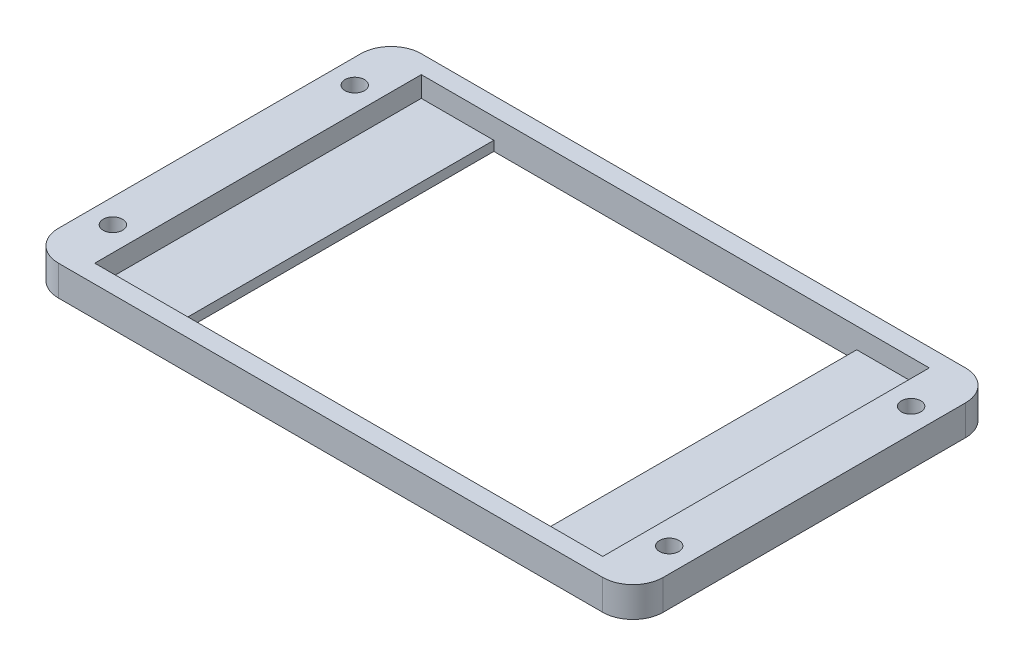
ISO-10303-21;
HEADER;
FILE_DESCRIPTION(('STEP AP214'),'2;1');
FILE_NAME('part.step','',(''),(''),'','','');
FILE_SCHEMA(('AUTOMOTIVE_DESIGN { 1 0 10303 214 1 1 1 1 }'));
ENDSEC;
DATA;
#1=APPLICATION_CONTEXT('core data for automotive mechanical design processes');
#2=APPLICATION_PROTOCOL_DEFINITION('international standard','automotive_design',2000,#1);
#3=PRODUCT_CONTEXT('',#1,'mechanical');
#4=PRODUCT('Part','Part','',(#3));
#5=PRODUCT_RELATED_PRODUCT_CATEGORY('part','',(#4));
#6=PRODUCT_DEFINITION_FORMATION('','',#4);
#7=PRODUCT_DEFINITION_CONTEXT('part definition',#1,'design');
#8=PRODUCT_DEFINITION('design','',#6,#7);
#9=PRODUCT_DEFINITION_SHAPE('','',#8);
#10=(LENGTH_UNIT() NAMED_UNIT(*) SI_UNIT(.MILLI.,.METRE.));
#11=(NAMED_UNIT(*) PLANE_ANGLE_UNIT() SI_UNIT($,.RADIAN.));
#12=(NAMED_UNIT(*) SI_UNIT($,.STERADIAN.) SOLID_ANGLE_UNIT());
#13=UNCERTAINTY_MEASURE_WITH_UNIT(LENGTH_MEASURE(1.E-05),#10,'distance_accuracy_value','');
#14=(GEOMETRIC_REPRESENTATION_CONTEXT(3) GLOBAL_UNCERTAINTY_ASSIGNED_CONTEXT((#13)) GLOBAL_UNIT_ASSIGNED_CONTEXT((#10,
#11,#12)) REPRESENTATION_CONTEXT('',''));
#15=CARTESIAN_POINT('',(0.,0.,0.));
#16=DIRECTION('',(0.,0.,1.));
#17=DIRECTION('',(1.,0.,0.));
#18=AXIS2_PLACEMENT_3D('',#15,#16,#17);
#19=CARTESIAN_POINT('',(0.,2.032,0.));
#20=DIRECTION('',(0.,-1.,0.));
#21=DIRECTION('',(0.,0.,-1.));
#22=AXIS2_PLACEMENT_3D('',#19,#20,#21);
#23=PLANE('',#22);
#24=DIRECTION('',(0.,0.,1.));
#25=VECTOR('',#24,1.);
#26=CARTESIAN_POINT('',(25.4,2.032,-72.39));
#27=LINE('',#26,#25);
#28=CARTESIAN_POINT('',(25.4,2.032,-72.39));
#29=VERTEX_POINT('',#28);
#30=CARTESIAN_POINT('',(25.4,2.032,-3.81000000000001));
#31=VERTEX_POINT('',#30);
#32=EDGE_CURVE('E154',#29,#31,#27,.T.);
#33=ORIENTED_EDGE('',*,*,#32,.F.);
#34=DIRECTION('',(-1.,0.,0.));
#35=VECTOR('',#34,1.);
#36=CARTESIAN_POINT('',(10.16,2.032,-72.39));
#37=LINE('',#36,#35);
#38=CARTESIAN_POINT('',(10.16,2.032,-72.39));
#39=VERTEX_POINT('',#38);
#40=EDGE_CURVE('E289',#29,#39,#37,.T.);
#41=ORIENTED_EDGE('',*,*,#40,.T.);
#42=DIRECTION('',(0.,0.,1.));
#43=VECTOR('',#42,1.);
#44=CARTESIAN_POINT('',(10.16,2.032,-3.81000000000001));
#45=LINE('',#44,#43);
#46=CARTESIAN_POINT('',(10.16,2.032,-3.81000000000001));
#47=VERTEX_POINT('',#46);
#48=EDGE_CURVE('E285',#39,#47,#45,.T.);
#49=ORIENTED_EDGE('',*,*,#48,.T.);
#50=DIRECTION('',(1.,0.,0.));
#51=VECTOR('',#50,1.);
#52=CARTESIAN_POINT('',(10.16,2.032,-3.81000000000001));
#53=LINE('',#52,#51);
#54=EDGE_CURVE('E277',#47,#31,#53,.T.);
#55=ORIENTED_EDGE('',*,*,#54,.T.);
#56=EDGE_LOOP('',(#33,#41,#49,#55));
#57=FACE_BOUND('',#56,.T.);
#58=ADVANCED_FACE('F33',(#57),#23,.F.);
#59=DIRECTION('',(0.,0.,-1.));
#60=VECTOR('',#59,1.);
#61=CARTESIAN_POINT('',(101.6,2.032,-72.39));
#62=LINE('',#61,#60);
#63=CARTESIAN_POINT('',(101.6,2.032,-3.81000000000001));
#64=VERTEX_POINT('',#63);
#65=CARTESIAN_POINT('',(101.6,2.032,-72.39));
#66=VERTEX_POINT('',#65);
#67=EDGE_CURVE('E174',#64,#66,#62,.T.);
#68=ORIENTED_EDGE('',*,*,#67,.F.);
#69=CARTESIAN_POINT('',(116.84,2.032,-3.81000000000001));
#70=VERTEX_POINT('',#69);
#71=EDGE_CURVE('E281',#64,#70,#53,.T.);
#72=ORIENTED_EDGE('',*,*,#71,.T.);
#73=DIRECTION('',(0.,0.,-1.));
#74=VECTOR('',#73,1.);
#75=CARTESIAN_POINT('',(116.84,2.032,-3.81000000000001));
#76=LINE('',#75,#74);
#77=CARTESIAN_POINT('',(116.84,2.032,-72.39));
#78=VERTEX_POINT('',#77);
#79=EDGE_CURVE('E280',#70,#78,#76,.T.);
#80=ORIENTED_EDGE('',*,*,#79,.T.);
#81=EDGE_CURVE('E296',#78,#66,#37,.T.);
#82=ORIENTED_EDGE('',*,*,#81,.T.);
#83=EDGE_LOOP('',(#68,#72,#80,#82));
#84=FACE_BOUND('',#83,.T.);
#85=ADVANCED_FACE('F357',(#84),#23,.F.);
#86=CARTESIAN_POINT('',(0.,6.35,0.));
#87=DIRECTION('',(1.,0.,0.));
#88=DIRECTION('',(0.,0.,-1.));
#89=AXIS2_PLACEMENT_3D('',#86,#87,#88);
#90=PLANE('',#89);
#91=DIRECTION('',(0.,0.,1.));
#92=VECTOR('',#91,1.);
#93=CARTESIAN_POINT('',(0.,0.,0.));
#94=LINE('',#93,#92);
#95=CARTESIAN_POINT('',(0.,0.,-69.85));
#96=VERTEX_POINT('',#95);
#97=CARTESIAN_POINT('',(0.,0.,-6.35));
#98=VERTEX_POINT('',#97);
#99=EDGE_CURVE('E249',#96,#98,#94,.T.);
#100=ORIENTED_EDGE('',*,*,#99,.T.);
#101=DIRECTION('',(0.,-1.,0.));
#102=VECTOR('',#101,1.);
#103=CARTESIAN_POINT('',(0.,6.35,-6.35));
#104=LINE('',#103,#102);
#105=CARTESIAN_POINT('',(0.,6.35,-6.35));
#106=VERTEX_POINT('',#105);
#107=EDGE_CURVE('E239',#98,#106,#104,.F.);
#108=ORIENTED_EDGE('',*,*,#107,.T.);
#109=DIRECTION('',(0.,0.,1.));
#110=VECTOR('',#109,1.);
#111=CARTESIAN_POINT('',(0.,6.35,0.));
#112=LINE('',#111,#110);
#113=CARTESIAN_POINT('',(0.,6.35,-69.85));
#114=VERTEX_POINT('',#113);
#115=EDGE_CURVE('E246',#114,#106,#112,.T.);
#116=ORIENTED_EDGE('',*,*,#115,.F.);
#117=DIRECTION('',(0.,-1.,0.));
#118=VECTOR('',#117,1.);
#119=CARTESIAN_POINT('',(0.,6.35,-69.85));
#120=LINE('',#119,#118);
#121=EDGE_CURVE('E236',#114,#96,#120,.T.);
#122=ORIENTED_EDGE('',*,*,#121,.T.);
#123=EDGE_LOOP('',(#100,#108,#116,#122));
#124=FACE_BOUND('',#123,.T.);
#125=ADVANCED_FACE('F245',(#124),#90,.F.);
#126=CARTESIAN_POINT('',(0.,6.35,0.));
#127=DIRECTION('',(0.,0.,-1.));
#128=DIRECTION('',(-1.,0.,0.));
#129=AXIS2_PLACEMENT_3D('',#126,#127,#128);
#130=PLANE('',#129);
#131=DIRECTION('',(1.,0.,0.));
#132=VECTOR('',#131,1.);
#133=CARTESIAN_POINT('',(0.,0.,0.));
#134=LINE('',#133,#132);
#135=CARTESIAN_POINT('',(6.35,0.,0.));
#136=VERTEX_POINT('',#135);
#137=CARTESIAN_POINT('',(120.65,0.,0.));
#138=VERTEX_POINT('',#137);
#139=EDGE_CURVE('E265',#136,#138,#134,.T.);
#140=ORIENTED_EDGE('',*,*,#139,.T.);
#141=DIRECTION('',(0.,-1.,0.));
#142=VECTOR('',#141,1.);
#143=CARTESIAN_POINT('',(120.65,6.35,0.));
#144=LINE('',#143,#142);
#145=CARTESIAN_POINT('',(120.65,6.35,0.));
#146=VERTEX_POINT('',#145);
#147=EDGE_CURVE('E227',#138,#146,#144,.F.);
#148=ORIENTED_EDGE('',*,*,#147,.T.);
#149=DIRECTION('',(1.,0.,0.));
#150=VECTOR('',#149,1.);
#151=CARTESIAN_POINT('',(0.,6.35,0.));
#152=LINE('',#151,#150);
#153=CARTESIAN_POINT('',(6.35,6.35,0.));
#154=VERTEX_POINT('',#153);
#155=EDGE_CURVE('E256',#154,#146,#152,.T.);
#156=ORIENTED_EDGE('',*,*,#155,.F.);
#157=DIRECTION('',(0.,-1.,0.));
#158=VECTOR('',#157,1.);
#159=CARTESIAN_POINT('',(6.35,6.35,0.));
#160=LINE('',#159,#158);
#161=EDGE_CURVE('E224',#154,#136,#160,.T.);
#162=ORIENTED_EDGE('',*,*,#161,.T.);
#163=EDGE_LOOP('',(#140,#148,#156,#162));
#164=FACE_BOUND('',#163,.T.);
#165=ADVANCED_FACE('F264',(#164),#130,.F.);
#166=CARTESIAN_POINT('',(127.,6.35,0.));
#167=DIRECTION('',(-1.,0.,0.));
#168=DIRECTION('',(0.,0.,1.));
#169=AXIS2_PLACEMENT_3D('',#166,#167,#168);
#170=PLANE('',#169);
#171=DIRECTION('',(0.,0.,-1.));
#172=VECTOR('',#171,1.);
#173=CARTESIAN_POINT('',(127.,6.35,0.));
#174=LINE('',#173,#172);
#175=CARTESIAN_POINT('',(127.,6.35,-6.35));
#176=VERTEX_POINT('',#175);
#177=CARTESIAN_POINT('',(127.,6.35,-69.85));
#178=VERTEX_POINT('',#177);
#179=EDGE_CURVE('E329',#176,#178,#174,.T.);
#180=ORIENTED_EDGE('',*,*,#179,.F.);
#181=DIRECTION('',(0.,-1.,0.));
#182=VECTOR('',#181,1.);
#183=CARTESIAN_POINT('',(127.,6.35,-6.35));
#184=LINE('',#183,#182);
#185=CARTESIAN_POINT('',(127.,0.,-6.35));
#186=VERTEX_POINT('',#185);
#187=EDGE_CURVE('E212',#176,#186,#184,.T.);
#188=ORIENTED_EDGE('',*,*,#187,.T.);
#189=DIRECTION('',(0.,0.,-1.));
#190=VECTOR('',#189,1.);
#191=CARTESIAN_POINT('',(127.,0.,0.));
#192=LINE('',#191,#190);
#193=CARTESIAN_POINT('',(127.,0.,-69.85));
#194=VERTEX_POINT('',#193);
#195=EDGE_CURVE('E268',#186,#194,#192,.T.);
#196=ORIENTED_EDGE('',*,*,#195,.T.);
#197=DIRECTION('',(0.,-1.,0.));
#198=VECTOR('',#197,1.);
#199=CARTESIAN_POINT('',(127.,6.35,-69.85));
#200=LINE('',#199,#198);
#201=EDGE_CURVE('E210',#194,#178,#200,.F.);
#202=ORIENTED_EDGE('',*,*,#201,.T.);
#203=EDGE_LOOP('',(#180,#188,#196,#202));
#204=FACE_BOUND('',#203,.T.);
#205=ADVANCED_FACE('F339',(#204),#170,.F.);
#206=CARTESIAN_POINT('',(0.,6.35,-76.2));
#207=DIRECTION('',(0.,0.,1.));
#208=DIRECTION('',(1.,0.,0.));
#209=AXIS2_PLACEMENT_3D('',#206,#207,#208);
#210=PLANE('',#209);
#211=DIRECTION('',(-1.,0.,0.));
#212=VECTOR('',#211,1.);
#213=CARTESIAN_POINT('',(0.,6.35,-76.2));
#214=LINE('',#213,#212);
#215=CARTESIAN_POINT('',(120.65,6.35,-76.2));
#216=VERTEX_POINT('',#215);
#217=CARTESIAN_POINT('',(6.34999999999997,6.35,-76.2));
#218=VERTEX_POINT('',#217);
#219=EDGE_CURVE('E213',#216,#218,#214,.T.);
#220=ORIENTED_EDGE('',*,*,#219,.F.);
#221=DIRECTION('',(0.,-1.,0.));
#222=VECTOR('',#221,1.);
#223=CARTESIAN_POINT('',(120.65,6.35,-76.2));
#224=LINE('',#223,#222);
#225=CARTESIAN_POINT('',(120.65,0.,-76.2));
#226=VERTEX_POINT('',#225);
#227=EDGE_CURVE('E11',#216,#226,#224,.T.);
#228=ORIENTED_EDGE('',*,*,#227,.T.);
#229=DIRECTION('',(-1.,0.,0.));
#230=VECTOR('',#229,1.);
#231=CARTESIAN_POINT('',(0.,0.,-76.2));
#232=LINE('',#231,#230);
#233=CARTESIAN_POINT('',(6.34999999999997,0.,-76.2));
#234=VERTEX_POINT('',#233);
#235=EDGE_CURVE('E257',#226,#234,#232,.T.);
#236=ORIENTED_EDGE('',*,*,#235,.T.);
#237=DIRECTION('',(0.,-1.,0.));
#238=VECTOR('',#237,1.);
#239=CARTESIAN_POINT('',(6.34999999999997,6.35,-76.2));
#240=LINE('',#239,#238);
#241=EDGE_CURVE('E41',#234,#218,#240,.F.);
#242=ORIENTED_EDGE('',*,*,#241,.T.);
#243=EDGE_LOOP('',(#220,#228,#236,#242));
#244=FACE_BOUND('',#243,.T.);
#245=ADVANCED_FACE('F333',(#244),#210,.F.);
#246=CARTESIAN_POINT('',(0.,6.35,0.));
#247=DIRECTION('',(0.,-1.,0.));
#248=DIRECTION('',(0.,0.,-1.));
#249=AXIS2_PLACEMENT_3D('',#246,#247,#248);
#250=PLANE('',#249);
#251=CARTESIAN_POINT('',(121.92,6.35,-12.7));
#252=DIRECTION('',(0.,1.,0.));
#253=DIRECTION('',(0.,0.,1.));
#254=AXIS2_PLACEMENT_3D('',#251,#252,#253);
#255=CIRCLE('',#254,2.03200000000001);
#256=CARTESIAN_POINT('',(121.92,6.35,-10.668));
#257=VERTEX_POINT('',#256);
#258=EDGE_CURVE('E209',#257,#257,#255,.T.);
#259=ORIENTED_EDGE('',*,*,#258,.F.);
#260=EDGE_LOOP('',(#259));
#261=FACE_BOUND('',#260,.T.);
#262=CARTESIAN_POINT('',(121.92,6.35,-63.5));
#263=DIRECTION('',(0.,1.,0.));
#264=DIRECTION('',(0.,0.,1.));
#265=AXIS2_PLACEMENT_3D('',#262,#263,#264);
#266=CIRCLE('',#265,2.03200000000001);
#267=CARTESIAN_POINT('',(121.92,6.35,-61.468));
#268=VERTEX_POINT('',#267);
#269=EDGE_CURVE('E205',#268,#268,#266,.T.);
#270=ORIENTED_EDGE('',*,*,#269,.F.);
#271=EDGE_LOOP('',(#270));
#272=FACE_BOUND('',#271,.T.);
#273=CARTESIAN_POINT('',(5.07999999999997,6.35,-12.7));
#274=DIRECTION('',(0.,1.,0.));
#275=DIRECTION('',(0.,0.,1.));
#276=AXIS2_PLACEMENT_3D('',#273,#274,#275);
#277=CIRCLE('',#276,2.032);
#278=CARTESIAN_POINT('',(5.07999999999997,6.35,-10.668));
#279=VERTEX_POINT('',#278);
#280=EDGE_CURVE('E201',#279,#279,#277,.T.);
#281=ORIENTED_EDGE('',*,*,#280,.F.);
#282=EDGE_LOOP('',(#281));
#283=FACE_BOUND('',#282,.T.);
#284=CARTESIAN_POINT('',(5.07999999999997,6.35,-63.5));
#285=DIRECTION('',(0.,1.,0.));
#286=DIRECTION('',(0.,0.,1.));
#287=AXIS2_PLACEMENT_3D('',#284,#285,#286);
#288=CIRCLE('',#287,2.032);
#289=CARTESIAN_POINT('',(5.07999999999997,6.35,-61.468));
#290=VERTEX_POINT('',#289);
#291=EDGE_CURVE('E179',#290,#290,#288,.T.);
#292=ORIENTED_EDGE('',*,*,#291,.F.);
#293=EDGE_LOOP('',(#292));
#294=FACE_BOUND('',#293,.T.);
#295=DIRECTION('',(1.,0.,0.));
#296=VECTOR('',#295,1.);
#297=CARTESIAN_POINT('',(10.16,6.35,-3.81000000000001));
#298=LINE('',#297,#296);
#299=CARTESIAN_POINT('',(10.16,6.35,-3.81000000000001));
#300=VERTEX_POINT('',#299);
#301=CARTESIAN_POINT('',(116.84,6.35,-3.81000000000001));
#302=VERTEX_POINT('',#301);
#303=EDGE_CURVE('E323',#300,#302,#298,.T.);
#304=ORIENTED_EDGE('',*,*,#303,.F.);
#305=DIRECTION('',(0.,0.,1.));
#306=VECTOR('',#305,1.);
#307=CARTESIAN_POINT('',(10.16,6.35,-3.81000000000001));
#308=LINE('',#307,#306);
#309=CARTESIAN_POINT('',(10.16,6.35,-72.39));
#310=VERTEX_POINT('',#309);
#311=EDGE_CURVE('E292',#310,#300,#308,.T.);
#312=ORIENTED_EDGE('',*,*,#311,.F.);
#313=DIRECTION('',(-1.,0.,0.));
#314=VECTOR('',#313,1.);
#315=CARTESIAN_POINT('',(10.16,6.35,-72.39));
#316=LINE('',#315,#314);
#317=CARTESIAN_POINT('',(116.84,6.35,-72.39));
#318=VERTEX_POINT('',#317);
#319=EDGE_CURVE('E314',#318,#310,#316,.T.);
#320=ORIENTED_EDGE('',*,*,#319,.F.);
#321=DIRECTION('',(0.,0.,-1.));
#322=VECTOR('',#321,1.);
#323=CARTESIAN_POINT('',(116.84,6.35,-3.81000000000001));
#324=LINE('',#323,#322);
#325=EDGE_CURVE('E320',#302,#318,#324,.T.);
#326=ORIENTED_EDGE('',*,*,#325,.F.);
#327=EDGE_LOOP('',(#304,#312,#320,#326));
#328=FACE_BOUND('',#327,.T.);
#329=ORIENTED_EDGE('',*,*,#155,.T.);
#330=CARTESIAN_POINT('',(120.65,6.35,-6.35));
#331=DIRECTION('',(0.,-1.,0.));
#332=DIRECTION('',(0.,0.,-1.));
#333=AXIS2_PLACEMENT_3D('',#330,#331,#332);
#334=CIRCLE('',#333,6.35);
#335=EDGE_CURVE('E234',#146,#176,#334,.F.);
#336=ORIENTED_EDGE('',*,*,#335,.T.);
#337=ORIENTED_EDGE('',*,*,#179,.T.);
#338=CARTESIAN_POINT('',(120.65,6.35,-69.85));
#339=DIRECTION('',(0.,-1.,0.));
#340=DIRECTION('',(0.,0.,-1.));
#341=AXIS2_PLACEMENT_3D('',#338,#339,#340);
#342=CIRCLE('',#341,6.35);
#343=EDGE_CURVE('E54',#178,#216,#342,.F.);
#344=ORIENTED_EDGE('',*,*,#343,.T.);
#345=ORIENTED_EDGE('',*,*,#219,.T.);
#346=CARTESIAN_POINT('',(6.34999999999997,6.35,-69.85));
#347=DIRECTION('',(0.,-1.,0.));
#348=DIRECTION('',(0.,0.,-1.));
#349=AXIS2_PLACEMENT_3D('',#346,#347,#348);
#350=CIRCLE('',#349,6.35);
#351=EDGE_CURVE('E229',#218,#114,#350,.F.);
#352=ORIENTED_EDGE('',*,*,#351,.T.);
#353=ORIENTED_EDGE('',*,*,#115,.T.);
#354=CARTESIAN_POINT('',(6.35,6.35,-6.35));
#355=DIRECTION('',(0.,-1.,0.));
#356=DIRECTION('',(0.,0.,-1.));
#357=AXIS2_PLACEMENT_3D('',#354,#355,#356);
#358=CIRCLE('',#357,6.35);
#359=EDGE_CURVE('E232',#106,#154,#358,.F.);
#360=ORIENTED_EDGE('',*,*,#359,.T.);
#361=EDGE_LOOP('',(#329,#336,#337,#344,#345,#352,#353,#360));
#362=FACE_BOUND('',#361,.T.);
#363=ADVANCED_FACE('F253',(#261,#272,#283,#294,#328,#362),#250,.F.);
#364=CARTESIAN_POINT('',(0.,0.,0.));
#365=DIRECTION('',(0.,-1.,0.));
#366=DIRECTION('',(0.,0.,-1.));
#367=AXIS2_PLACEMENT_3D('',#364,#365,#366);
#368=PLANE('',#367);
#369=CARTESIAN_POINT('',(121.92,0.,-12.7));
#370=DIRECTION('',(0.,-1.,0.));
#371=DIRECTION('',(0.,0.,-1.));
#372=AXIS2_PLACEMENT_3D('',#369,#370,#371);
#373=CIRCLE('',#372,2.03200000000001);
#374=CARTESIAN_POINT('',(121.92,0.,-10.668));
#375=VERTEX_POINT('',#374);
#376=EDGE_CURVE('E206',#375,#375,#373,.T.);
#377=ORIENTED_EDGE('',*,*,#376,.F.);
#378=EDGE_LOOP('',(#377));
#379=FACE_BOUND('',#378,.T.);
#380=CARTESIAN_POINT('',(121.92,0.,-63.5));
#381=DIRECTION('',(0.,-1.,0.));
#382=DIRECTION('',(0.,0.,-1.));
#383=AXIS2_PLACEMENT_3D('',#380,#381,#382);
#384=CIRCLE('',#383,2.03200000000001);
#385=CARTESIAN_POINT('',(121.92,0.,-61.468));
#386=VERTEX_POINT('',#385);
#387=EDGE_CURVE('E202',#386,#386,#384,.T.);
#388=ORIENTED_EDGE('',*,*,#387,.F.);
#389=EDGE_LOOP('',(#388));
#390=FACE_BOUND('',#389,.T.);
#391=CARTESIAN_POINT('',(5.07999999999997,0.,-12.7));
#392=DIRECTION('',(0.,-1.,0.));
#393=DIRECTION('',(0.,0.,-1.));
#394=AXIS2_PLACEMENT_3D('',#391,#392,#393);
#395=CIRCLE('',#394,2.032);
#396=CARTESIAN_POINT('',(5.07999999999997,0.,-10.668));
#397=VERTEX_POINT('',#396);
#398=EDGE_CURVE('E198',#397,#397,#395,.T.);
#399=ORIENTED_EDGE('',*,*,#398,.F.);
#400=EDGE_LOOP('',(#399));
#401=FACE_BOUND('',#400,.T.);
#402=CARTESIAN_POINT('',(5.07999999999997,0.,-63.5));
#403=DIRECTION('',(0.,-1.,0.));
#404=DIRECTION('',(0.,0.,-1.));
#405=AXIS2_PLACEMENT_3D('',#402,#403,#404);
#406=CIRCLE('',#405,2.032);
#407=CARTESIAN_POINT('',(5.07999999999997,0.,-61.468));
#408=VERTEX_POINT('',#407);
#409=EDGE_CURVE('E190',#408,#408,#406,.T.);
#410=ORIENTED_EDGE('',*,*,#409,.F.);
#411=EDGE_LOOP('',(#410));
#412=FACE_BOUND('',#411,.T.);
#413=DIRECTION('',(0.,0.,1.));
#414=VECTOR('',#413,1.);
#415=CARTESIAN_POINT('',(25.4,0.,-72.39));
#416=LINE('',#415,#414);
#417=CARTESIAN_POINT('',(25.4,0.,-72.39));
#418=VERTEX_POINT('',#417);
#419=CARTESIAN_POINT('',(25.4,0.,-3.81000000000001));
#420=VERTEX_POINT('',#419);
#421=EDGE_CURVE('E151',#418,#420,#416,.T.);
#422=ORIENTED_EDGE('',*,*,#421,.T.);
#423=DIRECTION('',(1.,0.,0.));
#424=VECTOR('',#423,1.);
#425=CARTESIAN_POINT('',(25.4,0.,-3.81000000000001));
#426=LINE('',#425,#424);
#427=CARTESIAN_POINT('',(101.6,0.,-3.81000000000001));
#428=VERTEX_POINT('',#427);
#429=EDGE_CURVE('E163',#420,#428,#426,.T.);
#430=ORIENTED_EDGE('',*,*,#429,.T.);
#431=DIRECTION('',(0.,0.,-1.));
#432=VECTOR('',#431,1.);
#433=CARTESIAN_POINT('',(101.6,0.,-72.39));
#434=LINE('',#433,#432);
#435=CARTESIAN_POINT('',(101.6,0.,-72.39));
#436=VERTEX_POINT('',#435);
#437=EDGE_CURVE('E169',#428,#436,#434,.T.);
#438=ORIENTED_EDGE('',*,*,#437,.T.);
#439=DIRECTION('',(-1.,0.,0.));
#440=VECTOR('',#439,1.);
#441=CARTESIAN_POINT('',(25.4,0.,-72.39));
#442=LINE('',#441,#440);
#443=EDGE_CURVE('E159',#436,#418,#442,.T.);
#444=ORIENTED_EDGE('',*,*,#443,.T.);
#445=EDGE_LOOP('',(#422,#430,#438,#444));
#446=FACE_BOUND('',#445,.T.);
#447=ORIENTED_EDGE('',*,*,#195,.F.);
#448=CARTESIAN_POINT('',(120.65,0.,-6.35));
#449=DIRECTION('',(0.,-1.,0.));
#450=DIRECTION('',(0.,0.,-1.));
#451=AXIS2_PLACEMENT_3D('',#448,#449,#450);
#452=CIRCLE('',#451,6.35);
#453=EDGE_CURVE('E222',#186,#138,#452,.T.);
#454=ORIENTED_EDGE('',*,*,#453,.T.);
#455=ORIENTED_EDGE('',*,*,#139,.F.);
#456=CARTESIAN_POINT('',(6.35,0.,-6.35));
#457=DIRECTION('',(0.,-1.,0.));
#458=DIRECTION('',(0.,0.,-1.));
#459=AXIS2_PLACEMENT_3D('',#456,#457,#458);
#460=CIRCLE('',#459,6.35);
#461=EDGE_CURVE('E220',#136,#98,#460,.T.);
#462=ORIENTED_EDGE('',*,*,#461,.T.);
#463=ORIENTED_EDGE('',*,*,#99,.F.);
#464=CARTESIAN_POINT('',(6.34999999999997,0.,-69.85));
#465=DIRECTION('',(0.,-1.,0.));
#466=DIRECTION('',(0.,0.,-1.));
#467=AXIS2_PLACEMENT_3D('',#464,#465,#466);
#468=CIRCLE('',#467,6.35);
#469=EDGE_CURVE('E216',#96,#234,#468,.T.);
#470=ORIENTED_EDGE('',*,*,#469,.T.);
#471=ORIENTED_EDGE('',*,*,#235,.F.);
#472=CARTESIAN_POINT('',(120.65,0.,-69.85));
#473=DIRECTION('',(0.,-1.,0.));
#474=DIRECTION('',(0.,0.,-1.));
#475=AXIS2_PLACEMENT_3D('',#472,#473,#474);
#476=CIRCLE('',#475,6.35);
#477=EDGE_CURVE('E218',#226,#194,#476,.T.);
#478=ORIENTED_EDGE('',*,*,#477,.T.);
#479=EDGE_LOOP('',(#447,#454,#455,#462,#463,#470,#471,#478));
#480=FACE_BOUND('',#479,.T.);
#481=ADVANCED_FACE('F171',(#379,#390,#401,#412,#446,#480),#368,.T.);
#482=CARTESIAN_POINT('',(10.16,2.032,-3.81000000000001));
#483=DIRECTION('',(-1.,0.,0.));
#484=DIRECTION('',(0.,0.,1.));
#485=AXIS2_PLACEMENT_3D('',#482,#483,#484);
#486=PLANE('',#485);
#487=ORIENTED_EDGE('',*,*,#311,.T.);
#488=DIRECTION('',(0.,1.,0.));
#489=VECTOR('',#488,1.);
#490=CARTESIAN_POINT('',(10.16,2.032,-3.81000000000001));
#491=LINE('',#490,#489);
#492=EDGE_CURVE('E298',#47,#300,#491,.T.);
#493=ORIENTED_EDGE('',*,*,#492,.F.);
#494=ORIENTED_EDGE('',*,*,#48,.F.);
#495=DIRECTION('',(0.,1.,0.));
#496=VECTOR('',#495,1.);
#497=CARTESIAN_POINT('',(10.16,2.032,-72.39));
#498=LINE('',#497,#496);
#499=EDGE_CURVE('E272',#39,#310,#498,.T.);
#500=ORIENTED_EDGE('',*,*,#499,.T.);
#501=EDGE_LOOP('',(#487,#493,#494,#500));
#502=FACE_BOUND('',#501,.T.);
#503=ADVANCED_FACE('F319',(#502),#486,.F.);
#504=CARTESIAN_POINT('',(10.16,2.032,-72.39));
#505=DIRECTION('',(0.,0.,-1.));
#506=DIRECTION('',(-1.,0.,0.));
#507=AXIS2_PLACEMENT_3D('',#504,#505,#506);
#508=PLANE('',#507);
#509=ORIENTED_EDGE('',*,*,#319,.T.);
#510=ORIENTED_EDGE('',*,*,#499,.F.);
#511=ORIENTED_EDGE('',*,*,#40,.F.);
#512=DIRECTION('',(0.,1.,0.));
#513=VECTOR('',#512,1.);
#514=CARTESIAN_POINT('',(25.4,0.,-72.39));
#515=LINE('',#514,#513);
#516=EDGE_CURVE('E556',#418,#29,#515,.T.);
#517=ORIENTED_EDGE('',*,*,#516,.F.);
#518=ORIENTED_EDGE('',*,*,#443,.F.);
#519=DIRECTION('',(0.,1.,0.));
#520=VECTOR('',#519,1.);
#521=CARTESIAN_POINT('',(101.6,0.,-72.39));
#522=LINE('',#521,#520);
#523=EDGE_CURVE('E557',#436,#66,#522,.T.);
#524=ORIENTED_EDGE('',*,*,#523,.T.);
#525=ORIENTED_EDGE('',*,*,#81,.F.);
#526=DIRECTION('',(0.,1.,0.));
#527=VECTOR('',#526,1.);
#528=CARTESIAN_POINT('',(116.84,2.032,-72.39));
#529=LINE('',#528,#527);
#530=EDGE_CURVE('E317',#78,#318,#529,.T.);
#531=ORIENTED_EDGE('',*,*,#530,.T.);
#532=EDGE_LOOP('',(#509,#510,#511,#517,#518,#524,#525,#531));
#533=FACE_BOUND('',#532,.T.);
#534=ADVANCED_FACE('F312',(#533),#508,.F.);
#535=CARTESIAN_POINT('',(116.84,2.032,-3.81000000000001));
#536=DIRECTION('',(1.,0.,0.));
#537=DIRECTION('',(0.,0.,-1.));
#538=AXIS2_PLACEMENT_3D('',#535,#536,#537);
#539=PLANE('',#538);
#540=ORIENTED_EDGE('',*,*,#325,.T.);
#541=ORIENTED_EDGE('',*,*,#530,.F.);
#542=ORIENTED_EDGE('',*,*,#79,.F.);
#543=DIRECTION('',(0.,1.,0.));
#544=VECTOR('',#543,1.);
#545=CARTESIAN_POINT('',(116.84,2.032,-3.81000000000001));
#546=LINE('',#545,#544);
#547=EDGE_CURVE('E303',#70,#302,#546,.T.);
#548=ORIENTED_EDGE('',*,*,#547,.T.);
#549=EDGE_LOOP('',(#540,#541,#542,#548));
#550=FACE_BOUND('',#549,.T.);
#551=ADVANCED_FACE('F367',(#550),#539,.F.);
#552=CARTESIAN_POINT('',(10.16,2.032,-3.81000000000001));
#553=DIRECTION('',(0.,0.,1.));
#554=DIRECTION('',(1.,0.,0.));
#555=AXIS2_PLACEMENT_3D('',#552,#553,#554);
#556=PLANE('',#555);
#557=ORIENTED_EDGE('',*,*,#303,.T.);
#558=ORIENTED_EDGE('',*,*,#547,.F.);
#559=ORIENTED_EDGE('',*,*,#71,.F.);
#560=DIRECTION('',(0.,1.,0.));
#561=VECTOR('',#560,1.);
#562=CARTESIAN_POINT('',(101.6,0.,-3.81000000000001));
#563=LINE('',#562,#561);
#564=EDGE_CURVE('E158',#428,#64,#563,.T.);
#565=ORIENTED_EDGE('',*,*,#564,.F.);
#566=ORIENTED_EDGE('',*,*,#429,.F.);
#567=DIRECTION('',(0.,1.,0.));
#568=VECTOR('',#567,1.);
#569=CARTESIAN_POINT('',(25.4,0.,-3.81000000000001));
#570=LINE('',#569,#568);
#571=EDGE_CURVE('E147',#420,#31,#570,.T.);
#572=ORIENTED_EDGE('',*,*,#571,.T.);
#573=ORIENTED_EDGE('',*,*,#54,.F.);
#574=ORIENTED_EDGE('',*,*,#492,.T.);
#575=EDGE_LOOP('',(#557,#558,#559,#565,#566,#572,#573,#574));
#576=FACE_BOUND('',#575,.T.);
#577=ADVANCED_FACE('F165',(#576),#556,.F.);
#578=CARTESIAN_POINT('',(25.4,0.,-72.39));
#579=DIRECTION('',(-1.,0.,0.));
#580=DIRECTION('',(0.,0.,1.));
#581=AXIS2_PLACEMENT_3D('',#578,#579,#580);
#582=PLANE('',#581);
#583=ORIENTED_EDGE('',*,*,#32,.T.);
#584=ORIENTED_EDGE('',*,*,#571,.F.);
#585=ORIENTED_EDGE('',*,*,#421,.F.);
#586=ORIENTED_EDGE('',*,*,#516,.T.);
#587=EDGE_LOOP('',(#583,#584,#585,#586));
#588=FACE_BOUND('',#587,.T.);
#589=ADVANCED_FACE('F149',(#588),#582,.F.);
#590=CARTESIAN_POINT('',(101.6,0.,-72.39));
#591=DIRECTION('',(1.,0.,0.));
#592=DIRECTION('',(0.,0.,-1.));
#593=AXIS2_PLACEMENT_3D('',#590,#591,#592);
#594=PLANE('',#593);
#595=ORIENTED_EDGE('',*,*,#67,.T.);
#596=ORIENTED_EDGE('',*,*,#523,.F.);
#597=ORIENTED_EDGE('',*,*,#437,.F.);
#598=ORIENTED_EDGE('',*,*,#564,.T.);
#599=EDGE_LOOP('',(#595,#596,#597,#598));
#600=FACE_BOUND('',#599,.T.);
#601=ADVANCED_FACE('F434',(#600),#594,.F.);
#602=CARTESIAN_POINT('',(5.07999999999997,-2.49999999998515E-05,-63.5));
#603=DIRECTION('',(0.,1.,0.));
#604=DIRECTION('',(0.,0.,1.));
#605=AXIS2_PLACEMENT_3D('',#602,#603,#604);
#606=CYLINDRICAL_SURFACE('',#605,2.032);
#607=CARTESIAN_POINT('',(5.07999999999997,0.,-61.468));
#608=CARTESIAN_POINT('',(5.07999999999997,0.0661458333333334,-61.468));
#609=CARTESIAN_POINT('',(5.07999999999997,0.132291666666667,-61.468));
#610=CARTESIAN_POINT('',(5.07999999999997,0.264583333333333,-61.468));
#611=CARTESIAN_POINT('',(5.07999999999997,0.330729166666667,-61.468));
#612=CARTESIAN_POINT('',(5.07999999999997,0.463020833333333,-61.468));
#613=CARTESIAN_POINT('',(5.07999999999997,0.529166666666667,-61.468));
#614=CARTESIAN_POINT('',(5.07999999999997,0.661458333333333,-61.468));
#615=CARTESIAN_POINT('',(5.07999999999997,0.727604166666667,-61.468));
#616=CARTESIAN_POINT('',(5.07999999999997,0.859895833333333,-61.468));
#617=CARTESIAN_POINT('',(5.07999999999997,0.926041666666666,-61.468));
#618=CARTESIAN_POINT('',(5.07999999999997,1.05833333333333,-61.468));
#619=CARTESIAN_POINT('',(5.07999999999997,1.12447916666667,-61.468));
#620=CARTESIAN_POINT('',(5.07999999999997,1.25677083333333,-61.468));
#621=CARTESIAN_POINT('',(5.07999999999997,1.32291666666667,-61.468));
#622=CARTESIAN_POINT('',(5.07999999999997,1.45520833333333,-61.468));
#623=CARTESIAN_POINT('',(5.07999999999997,1.52135416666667,-61.468));
#624=CARTESIAN_POINT('',(5.07999999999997,1.65364583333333,-61.468));
#625=CARTESIAN_POINT('',(5.07999999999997,1.71979166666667,-61.468));
#626=CARTESIAN_POINT('',(5.07999999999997,1.85208333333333,-61.468));
#627=CARTESIAN_POINT('',(5.07999999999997,1.91822916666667,-61.468));
#628=CARTESIAN_POINT('',(5.07999999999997,2.05052083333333,-61.468));
#629=CARTESIAN_POINT('',(5.07999999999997,2.11666666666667,-61.468));
#630=CARTESIAN_POINT('',(5.07999999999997,2.24895833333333,-61.468));
#631=CARTESIAN_POINT('',(5.07999999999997,2.31510416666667,-61.468));
#632=CARTESIAN_POINT('',(5.07999999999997,2.44739583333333,-61.468));
#633=CARTESIAN_POINT('',(5.07999999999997,2.51354166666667,-61.468));
#634=CARTESIAN_POINT('',(5.07999999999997,2.64583333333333,-61.468));
#635=CARTESIAN_POINT('',(5.07999999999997,2.71197916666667,-61.468));
#636=CARTESIAN_POINT('',(5.07999999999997,2.84427083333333,-61.468));
#637=CARTESIAN_POINT('',(5.07999999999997,2.91041666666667,-61.468));
#638=CARTESIAN_POINT('',(5.07999999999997,3.04270833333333,-61.468));
#639=CARTESIAN_POINT('',(5.07999999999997,3.10885416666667,-61.468));
#640=CARTESIAN_POINT('',(5.07999999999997,3.24114583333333,-61.468));
#641=CARTESIAN_POINT('',(5.07999999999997,3.30729166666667,-61.468));
#642=CARTESIAN_POINT('',(5.07999999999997,3.43958333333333,-61.468));
#643=CARTESIAN_POINT('',(5.07999999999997,3.50572916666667,-61.468));
#644=CARTESIAN_POINT('',(5.07999999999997,3.63802083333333,-61.468));
#645=CARTESIAN_POINT('',(5.07999999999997,3.70416666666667,-61.468));
#646=CARTESIAN_POINT('',(5.07999999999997,3.83645833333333,-61.468));
#647=CARTESIAN_POINT('',(5.07999999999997,3.90260416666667,-61.468));
#648=CARTESIAN_POINT('',(5.07999999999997,4.03489583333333,-61.468));
#649=CARTESIAN_POINT('',(5.07999999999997,4.10104166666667,-61.468));
#650=CARTESIAN_POINT('',(5.07999999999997,4.23333333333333,-61.468));
#651=CARTESIAN_POINT('',(5.07999999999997,4.29947916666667,-61.468));
#652=CARTESIAN_POINT('',(5.07999999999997,4.43177083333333,-61.468));
#653=CARTESIAN_POINT('',(5.07999999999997,4.49791666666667,-61.468));
#654=CARTESIAN_POINT('',(5.07999999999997,4.63020833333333,-61.468));
#655=CARTESIAN_POINT('',(5.07999999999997,4.69635416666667,-61.468));
#656=CARTESIAN_POINT('',(5.07999999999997,4.82864583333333,-61.468));
#657=CARTESIAN_POINT('',(5.07999999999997,4.89479166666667,-61.468));
#658=CARTESIAN_POINT('',(5.07999999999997,5.02708333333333,-61.468));
#659=CARTESIAN_POINT('',(5.07999999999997,5.09322916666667,-61.468));
#660=CARTESIAN_POINT('',(5.07999999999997,5.22552083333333,-61.468));
#661=CARTESIAN_POINT('',(5.07999999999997,5.29166666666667,-61.468));
#662=CARTESIAN_POINT('',(5.07999999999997,5.42395833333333,-61.468));
#663=CARTESIAN_POINT('',(5.07999999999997,5.49010416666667,-61.468));
#664=CARTESIAN_POINT('',(5.07999999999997,5.62239583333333,-61.468));
#665=CARTESIAN_POINT('',(5.07999999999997,5.68854166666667,-61.468));
#666=CARTESIAN_POINT('',(5.07999999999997,5.82083333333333,-61.468));
#667=CARTESIAN_POINT('',(5.07999999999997,5.88697916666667,-61.468));
#668=CARTESIAN_POINT('',(5.07999999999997,6.01927083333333,-61.468));
#669=CARTESIAN_POINT('',(5.07999999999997,6.08541666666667,-61.468));
#670=CARTESIAN_POINT('',(5.07999999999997,6.21770833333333,-61.468));
#671=CARTESIAN_POINT('',(5.07999999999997,6.28385416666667,-61.468));
#672=CARTESIAN_POINT('',(5.07999999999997,6.35,-61.468));
#673=B_SPLINE_CURVE_WITH_KNOTS('',3,(#607,#608,#609,#610,#611,#612,#613,#614,#615,#616,#617,
#618,#619,#620,#621,#622,#623,#624,#625,#626,#627,#628,#629,#630,#631,#632,#633,#634,#635,#636,
#637,#638,#639,#640,#641,#642,#643,#644,#645,#646,#647,#648,#649,#650,#651,#652,#653,#654,#655,
#656,#657,#658,#659,#660,#661,#662,#663,#664,#665,#666,#667,#668,#669,#670,#671,#672),
.UNSPECIFIED.,.F.,.F.,(4,2,2,2,2,2,2,2,2,2,2,2,2,2,2,2,2,2,2,2,2,2,2,2,2,2,2,2,2,2,2,2,4),(0.,
0.1984375,0.396875,0.5953125,0.79375,0.9921875,1.190625,1.3890625,1.5875,1.7859375,1.984375,
2.1828125,2.38125,2.5796875,2.778125,2.9765625,3.175,3.3734375,3.571875,3.7703125,3.96875,
4.1671875,4.365625,4.5640625,4.7625,4.9609375,5.159375,5.3578125,5.55625,5.7546875,5.953125,
6.1515625,6.35),.UNSPECIFIED.);
#674=EDGE_CURVE('BSEAM440',#408,#290,#673,.T.);
#675=ORIENTED_EDGE('',*,*,#409,.T.);
#676=ORIENTED_EDGE('',*,*,#291,.T.);
#677=ORIENTED_EDGE('',*,*,#674,.T.);
#678=ORIENTED_EDGE('',*,*,#674,.F.);
#679=EDGE_LOOP('',(#675,#677,#676,#678));
#680=FACE_BOUND('',#679,.T.);
#681=ADVANCED_FACE('F440',(#680),#606,.F.);
#682=CARTESIAN_POINT('',(5.07999999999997,-2.49999999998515E-05,-12.7));
#683=DIRECTION('',(0.,1.,0.));
#684=DIRECTION('',(0.,0.,1.));
#685=AXIS2_PLACEMENT_3D('',#682,#683,#684);
#686=CYLINDRICAL_SURFACE('',#685,2.032);
#687=CARTESIAN_POINT('',(5.07999999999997,0.,-10.668));
#688=CARTESIAN_POINT('',(5.07999999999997,0.0661458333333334,-10.668));
#689=CARTESIAN_POINT('',(5.07999999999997,0.132291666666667,-10.668));
#690=CARTESIAN_POINT('',(5.07999999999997,0.264583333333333,-10.668));
#691=CARTESIAN_POINT('',(5.07999999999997,0.330729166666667,-10.668));
#692=CARTESIAN_POINT('',(5.07999999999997,0.463020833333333,-10.668));
#693=CARTESIAN_POINT('',(5.07999999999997,0.529166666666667,-10.668));
#694=CARTESIAN_POINT('',(5.07999999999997,0.661458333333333,-10.668));
#695=CARTESIAN_POINT('',(5.07999999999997,0.727604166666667,-10.668));
#696=CARTESIAN_POINT('',(5.07999999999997,0.859895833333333,-10.668));
#697=CARTESIAN_POINT('',(5.07999999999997,0.926041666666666,-10.668));
#698=CARTESIAN_POINT('',(5.07999999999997,1.05833333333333,-10.668));
#699=CARTESIAN_POINT('',(5.07999999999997,1.12447916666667,-10.668));
#700=CARTESIAN_POINT('',(5.07999999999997,1.25677083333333,-10.668));
#701=CARTESIAN_POINT('',(5.07999999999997,1.32291666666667,-10.668));
#702=CARTESIAN_POINT('',(5.07999999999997,1.45520833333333,-10.668));
#703=CARTESIAN_POINT('',(5.07999999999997,1.52135416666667,-10.668));
#704=CARTESIAN_POINT('',(5.07999999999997,1.65364583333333,-10.668));
#705=CARTESIAN_POINT('',(5.07999999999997,1.71979166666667,-10.668));
#706=CARTESIAN_POINT('',(5.07999999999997,1.85208333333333,-10.668));
#707=CARTESIAN_POINT('',(5.07999999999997,1.91822916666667,-10.668));
#708=CARTESIAN_POINT('',(5.07999999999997,2.05052083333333,-10.668));
#709=CARTESIAN_POINT('',(5.07999999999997,2.11666666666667,-10.668));
#710=CARTESIAN_POINT('',(5.07999999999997,2.24895833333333,-10.668));
#711=CARTESIAN_POINT('',(5.07999999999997,2.31510416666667,-10.668));
#712=CARTESIAN_POINT('',(5.07999999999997,2.44739583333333,-10.668));
#713=CARTESIAN_POINT('',(5.07999999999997,2.51354166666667,-10.668));
#714=CARTESIAN_POINT('',(5.07999999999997,2.64583333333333,-10.668));
#715=CARTESIAN_POINT('',(5.07999999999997,2.71197916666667,-10.668));
#716=CARTESIAN_POINT('',(5.07999999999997,2.84427083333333,-10.668));
#717=CARTESIAN_POINT('',(5.07999999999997,2.91041666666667,-10.668));
#718=CARTESIAN_POINT('',(5.07999999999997,3.04270833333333,-10.668));
#719=CARTESIAN_POINT('',(5.07999999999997,3.10885416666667,-10.668));
#720=CARTESIAN_POINT('',(5.07999999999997,3.24114583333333,-10.668));
#721=CARTESIAN_POINT('',(5.07999999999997,3.30729166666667,-10.668));
#722=CARTESIAN_POINT('',(5.07999999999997,3.43958333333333,-10.668));
#723=CARTESIAN_POINT('',(5.07999999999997,3.50572916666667,-10.668));
#724=CARTESIAN_POINT('',(5.07999999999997,3.63802083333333,-10.668));
#725=CARTESIAN_POINT('',(5.07999999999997,3.70416666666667,-10.668));
#726=CARTESIAN_POINT('',(5.07999999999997,3.83645833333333,-10.668));
#727=CARTESIAN_POINT('',(5.07999999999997,3.90260416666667,-10.668));
#728=CARTESIAN_POINT('',(5.07999999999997,4.03489583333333,-10.668));
#729=CARTESIAN_POINT('',(5.07999999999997,4.10104166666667,-10.668));
#730=CARTESIAN_POINT('',(5.07999999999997,4.23333333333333,-10.668));
#731=CARTESIAN_POINT('',(5.07999999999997,4.29947916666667,-10.668));
#732=CARTESIAN_POINT('',(5.07999999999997,4.43177083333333,-10.668));
#733=CARTESIAN_POINT('',(5.07999999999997,4.49791666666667,-10.668));
#734=CARTESIAN_POINT('',(5.07999999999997,4.63020833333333,-10.668));
#735=CARTESIAN_POINT('',(5.07999999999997,4.69635416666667,-10.668));
#736=CARTESIAN_POINT('',(5.07999999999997,4.82864583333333,-10.668));
#737=CARTESIAN_POINT('',(5.07999999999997,4.89479166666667,-10.668));
#738=CARTESIAN_POINT('',(5.07999999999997,5.02708333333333,-10.668));
#739=CARTESIAN_POINT('',(5.07999999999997,5.09322916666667,-10.668));
#740=CARTESIAN_POINT('',(5.07999999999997,5.22552083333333,-10.668));
#741=CARTESIAN_POINT('',(5.07999999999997,5.29166666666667,-10.668));
#742=CARTESIAN_POINT('',(5.07999999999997,5.42395833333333,-10.668));
#743=CARTESIAN_POINT('',(5.07999999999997,5.49010416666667,-10.668));
#744=CARTESIAN_POINT('',(5.07999999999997,5.62239583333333,-10.668));
#745=CARTESIAN_POINT('',(5.07999999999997,5.68854166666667,-10.668));
#746=CARTESIAN_POINT('',(5.07999999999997,5.82083333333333,-10.668));
#747=CARTESIAN_POINT('',(5.07999999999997,5.88697916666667,-10.668));
#748=CARTESIAN_POINT('',(5.07999999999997,6.01927083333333,-10.668));
#749=CARTESIAN_POINT('',(5.07999999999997,6.08541666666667,-10.668));
#750=CARTESIAN_POINT('',(5.07999999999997,6.21770833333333,-10.668));
#751=CARTESIAN_POINT('',(5.07999999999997,6.28385416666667,-10.668));
#752=CARTESIAN_POINT('',(5.07999999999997,6.35,-10.668));
#753=B_SPLINE_CURVE_WITH_KNOTS('',3,(#687,#688,#689,#690,#691,#692,#693,#694,#695,#696,#697,
#698,#699,#700,#701,#702,#703,#704,#705,#706,#707,#708,#709,#710,#711,#712,#713,#714,#715,#716,
#717,#718,#719,#720,#721,#722,#723,#724,#725,#726,#727,#728,#729,#730,#731,#732,#733,#734,#735,
#736,#737,#738,#739,#740,#741,#742,#743,#744,#745,#746,#747,#748,#749,#750,#751,#752),
.UNSPECIFIED.,.F.,.F.,(4,2,2,2,2,2,2,2,2,2,2,2,2,2,2,2,2,2,2,2,2,2,2,2,2,2,2,2,2,2,2,2,4),(0.,
0.1984375,0.396875,0.5953125,0.79375,0.9921875,1.190625,1.3890625,1.5875,1.7859375,1.984375,
2.1828125,2.38125,2.5796875,2.778125,2.9765625,3.175,3.3734375,3.571875,3.7703125,3.96875,
4.1671875,4.365625,4.5640625,4.7625,4.9609375,5.159375,5.3578125,5.55625,5.7546875,5.953125,
6.1515625,6.35),.UNSPECIFIED.);
#754=EDGE_CURVE('BSEAM447',#397,#279,#753,.T.);
#755=ORIENTED_EDGE('',*,*,#398,.T.);
#756=ORIENTED_EDGE('',*,*,#280,.T.);
#757=ORIENTED_EDGE('',*,*,#754,.T.);
#758=ORIENTED_EDGE('',*,*,#754,.F.);
#759=EDGE_LOOP('',(#755,#757,#756,#758));
#760=FACE_BOUND('',#759,.T.);
#761=ADVANCED_FACE('F447',(#760),#686,.F.);
#762=CARTESIAN_POINT('',(121.92,-2.49999999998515E-05,-63.5));
#763=DIRECTION('',(0.,1.,0.));
#764=DIRECTION('',(0.,0.,1.));
#765=AXIS2_PLACEMENT_3D('',#762,#763,#764);
#766=CYLINDRICAL_SURFACE('',#765,2.03200000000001);
#767=CARTESIAN_POINT('',(121.92,0.,-61.468));
#768=CARTESIAN_POINT('',(121.92,0.0661458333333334,-61.468));
#769=CARTESIAN_POINT('',(121.92,0.132291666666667,-61.468));
#770=CARTESIAN_POINT('',(121.92,0.264583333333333,-61.468));
#771=CARTESIAN_POINT('',(121.92,0.330729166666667,-61.468));
#772=CARTESIAN_POINT('',(121.92,0.463020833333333,-61.468));
#773=CARTESIAN_POINT('',(121.92,0.529166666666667,-61.468));
#774=CARTESIAN_POINT('',(121.92,0.661458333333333,-61.468));
#775=CARTESIAN_POINT('',(121.92,0.727604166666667,-61.468));
#776=CARTESIAN_POINT('',(121.92,0.859895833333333,-61.468));
#777=CARTESIAN_POINT('',(121.92,0.926041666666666,-61.468));
#778=CARTESIAN_POINT('',(121.92,1.05833333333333,-61.468));
#779=CARTESIAN_POINT('',(121.92,1.12447916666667,-61.468));
#780=CARTESIAN_POINT('',(121.92,1.25677083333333,-61.468));
#781=CARTESIAN_POINT('',(121.92,1.32291666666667,-61.468));
#782=CARTESIAN_POINT('',(121.92,1.45520833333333,-61.468));
#783=CARTESIAN_POINT('',(121.92,1.52135416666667,-61.468));
#784=CARTESIAN_POINT('',(121.92,1.65364583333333,-61.468));
#785=CARTESIAN_POINT('',(121.92,1.71979166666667,-61.468));
#786=CARTESIAN_POINT('',(121.92,1.85208333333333,-61.468));
#787=CARTESIAN_POINT('',(121.92,1.91822916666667,-61.468));
#788=CARTESIAN_POINT('',(121.92,2.05052083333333,-61.468));
#789=CARTESIAN_POINT('',(121.92,2.11666666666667,-61.468));
#790=CARTESIAN_POINT('',(121.92,2.24895833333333,-61.468));
#791=CARTESIAN_POINT('',(121.92,2.31510416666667,-61.468));
#792=CARTESIAN_POINT('',(121.92,2.44739583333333,-61.468));
#793=CARTESIAN_POINT('',(121.92,2.51354166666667,-61.468));
#794=CARTESIAN_POINT('',(121.92,2.64583333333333,-61.468));
#795=CARTESIAN_POINT('',(121.92,2.71197916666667,-61.468));
#796=CARTESIAN_POINT('',(121.92,2.84427083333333,-61.468));
#797=CARTESIAN_POINT('',(121.92,2.91041666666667,-61.468));
#798=CARTESIAN_POINT('',(121.92,3.04270833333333,-61.468));
#799=CARTESIAN_POINT('',(121.92,3.10885416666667,-61.468));
#800=CARTESIAN_POINT('',(121.92,3.24114583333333,-61.468));
#801=CARTESIAN_POINT('',(121.92,3.30729166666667,-61.468));
#802=CARTESIAN_POINT('',(121.92,3.43958333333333,-61.468));
#803=CARTESIAN_POINT('',(121.92,3.50572916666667,-61.468));
#804=CARTESIAN_POINT('',(121.92,3.63802083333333,-61.468));
#805=CARTESIAN_POINT('',(121.92,3.70416666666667,-61.468));
#806=CARTESIAN_POINT('',(121.92,3.83645833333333,-61.468));
#807=CARTESIAN_POINT('',(121.92,3.90260416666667,-61.468));
#808=CARTESIAN_POINT('',(121.92,4.03489583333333,-61.468));
#809=CARTESIAN_POINT('',(121.92,4.10104166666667,-61.468));
#810=CARTESIAN_POINT('',(121.92,4.23333333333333,-61.468));
#811=CARTESIAN_POINT('',(121.92,4.29947916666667,-61.468));
#812=CARTESIAN_POINT('',(121.92,4.43177083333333,-61.468));
#813=CARTESIAN_POINT('',(121.92,4.49791666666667,-61.468));
#814=CARTESIAN_POINT('',(121.92,4.63020833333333,-61.468));
#815=CARTESIAN_POINT('',(121.92,4.69635416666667,-61.468));
#816=CARTESIAN_POINT('',(121.92,4.82864583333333,-61.468));
#817=CARTESIAN_POINT('',(121.92,4.89479166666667,-61.468));
#818=CARTESIAN_POINT('',(121.92,5.02708333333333,-61.468));
#819=CARTESIAN_POINT('',(121.92,5.09322916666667,-61.468));
#820=CARTESIAN_POINT('',(121.92,5.22552083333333,-61.468));
#821=CARTESIAN_POINT('',(121.92,5.29166666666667,-61.468));
#822=CARTESIAN_POINT('',(121.92,5.42395833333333,-61.468));
#823=CARTESIAN_POINT('',(121.92,5.49010416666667,-61.468));
#824=CARTESIAN_POINT('',(121.92,5.62239583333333,-61.468));
#825=CARTESIAN_POINT('',(121.92,5.68854166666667,-61.468));
#826=CARTESIAN_POINT('',(121.92,5.82083333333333,-61.468));
#827=CARTESIAN_POINT('',(121.92,5.88697916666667,-61.468));
#828=CARTESIAN_POINT('',(121.92,6.01927083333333,-61.468));
#829=CARTESIAN_POINT('',(121.92,6.08541666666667,-61.468));
#830=CARTESIAN_POINT('',(121.92,6.21770833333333,-61.468));
#831=CARTESIAN_POINT('',(121.92,6.28385416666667,-61.468));
#832=CARTESIAN_POINT('',(121.92,6.35,-61.468));
#833=B_SPLINE_CURVE_WITH_KNOTS('',3,(#767,#768,#769,#770,#771,#772,#773,#774,#775,#776,#777,
#778,#779,#780,#781,#782,#783,#784,#785,#786,#787,#788,#789,#790,#791,#792,#793,#794,#795,#796,
#797,#798,#799,#800,#801,#802,#803,#804,#805,#806,#807,#808,#809,#810,#811,#812,#813,#814,#815,
#816,#817,#818,#819,#820,#821,#822,#823,#824,#825,#826,#827,#828,#829,#830,#831,#832),
.UNSPECIFIED.,.F.,.F.,(4,2,2,2,2,2,2,2,2,2,2,2,2,2,2,2,2,2,2,2,2,2,2,2,2,2,2,2,2,2,2,2,4),(0.,
0.1984375,0.396875,0.5953125,0.79375,0.9921875,1.190625,1.3890625,1.5875,1.7859375,1.984375,
2.1828125,2.38125,2.5796875,2.778125,2.9765625,3.175,3.3734375,3.571875,3.7703125,3.96875,
4.1671875,4.365625,4.5640625,4.7625,4.9609375,5.159375,5.3578125,5.55625,5.7546875,5.953125,
6.1515625,6.35),.UNSPECIFIED.);
#834=EDGE_CURVE('BSEAM352',#386,#268,#833,.T.);
#835=ORIENTED_EDGE('',*,*,#387,.T.);
#836=ORIENTED_EDGE('',*,*,#269,.T.);
#837=ORIENTED_EDGE('',*,*,#834,.T.);
#838=ORIENTED_EDGE('',*,*,#834,.F.);
#839=EDGE_LOOP('',(#835,#837,#836,#838));
#840=FACE_BOUND('',#839,.T.);
#841=ADVANCED_FACE('F352',(#840),#766,.F.);
#842=CARTESIAN_POINT('',(121.92,-2.49999999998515E-05,-12.7));
#843=DIRECTION('',(0.,1.,0.));
#844=DIRECTION('',(0.,0.,1.));
#845=AXIS2_PLACEMENT_3D('',#842,#843,#844);
#846=CYLINDRICAL_SURFACE('',#845,2.03200000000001);
#847=CARTESIAN_POINT('',(121.92,0.,-10.668));
#848=CARTESIAN_POINT('',(121.92,0.0661458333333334,-10.668));
#849=CARTESIAN_POINT('',(121.92,0.132291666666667,-10.668));
#850=CARTESIAN_POINT('',(121.92,0.264583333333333,-10.668));
#851=CARTESIAN_POINT('',(121.92,0.330729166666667,-10.668));
#852=CARTESIAN_POINT('',(121.92,0.463020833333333,-10.668));
#853=CARTESIAN_POINT('',(121.92,0.529166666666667,-10.668));
#854=CARTESIAN_POINT('',(121.92,0.661458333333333,-10.668));
#855=CARTESIAN_POINT('',(121.92,0.727604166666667,-10.668));
#856=CARTESIAN_POINT('',(121.92,0.859895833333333,-10.668));
#857=CARTESIAN_POINT('',(121.92,0.926041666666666,-10.668));
#858=CARTESIAN_POINT('',(121.92,1.05833333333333,-10.668));
#859=CARTESIAN_POINT('',(121.92,1.12447916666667,-10.668));
#860=CARTESIAN_POINT('',(121.92,1.25677083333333,-10.668));
#861=CARTESIAN_POINT('',(121.92,1.32291666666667,-10.668));
#862=CARTESIAN_POINT('',(121.92,1.45520833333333,-10.668));
#863=CARTESIAN_POINT('',(121.92,1.52135416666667,-10.668));
#864=CARTESIAN_POINT('',(121.92,1.65364583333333,-10.668));
#865=CARTESIAN_POINT('',(121.92,1.71979166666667,-10.668));
#866=CARTESIAN_POINT('',(121.92,1.85208333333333,-10.668));
#867=CARTESIAN_POINT('',(121.92,1.91822916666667,-10.668));
#868=CARTESIAN_POINT('',(121.92,2.05052083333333,-10.668));
#869=CARTESIAN_POINT('',(121.92,2.11666666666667,-10.668));
#870=CARTESIAN_POINT('',(121.92,2.24895833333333,-10.668));
#871=CARTESIAN_POINT('',(121.92,2.31510416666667,-10.668));
#872=CARTESIAN_POINT('',(121.92,2.44739583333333,-10.668));
#873=CARTESIAN_POINT('',(121.92,2.51354166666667,-10.668));
#874=CARTESIAN_POINT('',(121.92,2.64583333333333,-10.668));
#875=CARTESIAN_POINT('',(121.92,2.71197916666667,-10.668));
#876=CARTESIAN_POINT('',(121.92,2.84427083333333,-10.668));
#877=CARTESIAN_POINT('',(121.92,2.91041666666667,-10.668));
#878=CARTESIAN_POINT('',(121.92,3.04270833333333,-10.668));
#879=CARTESIAN_POINT('',(121.92,3.10885416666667,-10.668));
#880=CARTESIAN_POINT('',(121.92,3.24114583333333,-10.668));
#881=CARTESIAN_POINT('',(121.92,3.30729166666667,-10.668));
#882=CARTESIAN_POINT('',(121.92,3.43958333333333,-10.668));
#883=CARTESIAN_POINT('',(121.92,3.50572916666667,-10.668));
#884=CARTESIAN_POINT('',(121.92,3.63802083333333,-10.668));
#885=CARTESIAN_POINT('',(121.92,3.70416666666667,-10.668));
#886=CARTESIAN_POINT('',(121.92,3.83645833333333,-10.668));
#887=CARTESIAN_POINT('',(121.92,3.90260416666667,-10.668));
#888=CARTESIAN_POINT('',(121.92,4.03489583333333,-10.668));
#889=CARTESIAN_POINT('',(121.92,4.10104166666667,-10.668));
#890=CARTESIAN_POINT('',(121.92,4.23333333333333,-10.668));
#891=CARTESIAN_POINT('',(121.92,4.29947916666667,-10.668));
#892=CARTESIAN_POINT('',(121.92,4.43177083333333,-10.668));
#893=CARTESIAN_POINT('',(121.92,4.49791666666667,-10.668));
#894=CARTESIAN_POINT('',(121.92,4.63020833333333,-10.668));
#895=CARTESIAN_POINT('',(121.92,4.69635416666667,-10.668));
#896=CARTESIAN_POINT('',(121.92,4.82864583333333,-10.668));
#897=CARTESIAN_POINT('',(121.92,4.89479166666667,-10.668));
#898=CARTESIAN_POINT('',(121.92,5.02708333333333,-10.668));
#899=CARTESIAN_POINT('',(121.92,5.09322916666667,-10.668));
#900=CARTESIAN_POINT('',(121.92,5.22552083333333,-10.668));
#901=CARTESIAN_POINT('',(121.92,5.29166666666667,-10.668));
#902=CARTESIAN_POINT('',(121.92,5.42395833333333,-10.668));
#903=CARTESIAN_POINT('',(121.92,5.49010416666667,-10.668));
#904=CARTESIAN_POINT('',(121.92,5.62239583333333,-10.668));
#905=CARTESIAN_POINT('',(121.92,5.68854166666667,-10.668));
#906=CARTESIAN_POINT('',(121.92,5.82083333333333,-10.668));
#907=CARTESIAN_POINT('',(121.92,5.88697916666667,-10.668));
#908=CARTESIAN_POINT('',(121.92,6.01927083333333,-10.668));
#909=CARTESIAN_POINT('',(121.92,6.08541666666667,-10.668));
#910=CARTESIAN_POINT('',(121.92,6.21770833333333,-10.668));
#911=CARTESIAN_POINT('',(121.92,6.28385416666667,-10.668));
#912=CARTESIAN_POINT('',(121.92,6.35,-10.668));
#913=B_SPLINE_CURVE_WITH_KNOTS('',3,(#847,#848,#849,#850,#851,#852,#853,#854,#855,#856,#857,
#858,#859,#860,#861,#862,#863,#864,#865,#866,#867,#868,#869,#870,#871,#872,#873,#874,#875,#876,
#877,#878,#879,#880,#881,#882,#883,#884,#885,#886,#887,#888,#889,#890,#891,#892,#893,#894,#895,
#896,#897,#898,#899,#900,#901,#902,#903,#904,#905,#906,#907,#908,#909,#910,#911,#912),
.UNSPECIFIED.,.F.,.F.,(4,2,2,2,2,2,2,2,2,2,2,2,2,2,2,2,2,2,2,2,2,2,2,2,2,2,2,2,2,2,2,2,4),(0.,
0.1984375,0.396875,0.5953125,0.79375,0.9921875,1.190625,1.3890625,1.5875,1.7859375,1.984375,
2.1828125,2.38125,2.5796875,2.778125,2.9765625,3.175,3.3734375,3.571875,3.7703125,3.96875,
4.1671875,4.365625,4.5640625,4.7625,4.9609375,5.159375,5.3578125,5.55625,5.7546875,5.953125,
6.1515625,6.35),.UNSPECIFIED.);
#914=EDGE_CURVE('BSEAM345',#375,#257,#913,.T.);
#915=ORIENTED_EDGE('',*,*,#376,.T.);
#916=ORIENTED_EDGE('',*,*,#258,.T.);
#917=ORIENTED_EDGE('',*,*,#914,.T.);
#918=ORIENTED_EDGE('',*,*,#914,.F.);
#919=EDGE_LOOP('',(#915,#917,#916,#918));
#920=FACE_BOUND('',#919,.T.);
#921=ADVANCED_FACE('F345',(#920),#846,.F.);
#922=CARTESIAN_POINT('',(120.65,6.35,-6.35));
#923=DIRECTION('',(0.,-1.,0.));
#924=DIRECTION('',(0.,0.,-1.));
#925=AXIS2_PLACEMENT_3D('',#922,#923,#924);
#926=CYLINDRICAL_SURFACE('',#925,6.35);
#927=ORIENTED_EDGE('',*,*,#335,.F.);
#928=ORIENTED_EDGE('',*,*,#147,.F.);
#929=ORIENTED_EDGE('',*,*,#453,.F.);
#930=ORIENTED_EDGE('',*,*,#187,.F.);
#931=EDGE_LOOP('',(#927,#928,#929,#930));
#932=FACE_BOUND('',#931,.T.);
#933=ADVANCED_FACE('F343',(#932),#926,.T.);
#934=CARTESIAN_POINT('',(6.35,6.35,-6.35));
#935=DIRECTION('',(0.,-1.,0.));
#936=DIRECTION('',(0.,0.,-1.));
#937=AXIS2_PLACEMENT_3D('',#934,#935,#936);
#938=CYLINDRICAL_SURFACE('',#937,6.35);
#939=ORIENTED_EDGE('',*,*,#359,.F.);
#940=ORIENTED_EDGE('',*,*,#107,.F.);
#941=ORIENTED_EDGE('',*,*,#461,.F.);
#942=ORIENTED_EDGE('',*,*,#161,.F.);
#943=EDGE_LOOP('',(#939,#940,#941,#942));
#944=FACE_BOUND('',#943,.T.);
#945=ADVANCED_FACE('F260',(#944),#938,.T.);
#946=CARTESIAN_POINT('',(120.65,6.35,-69.85));
#947=DIRECTION('',(0.,-1.,0.));
#948=DIRECTION('',(0.,0.,-1.));
#949=AXIS2_PLACEMENT_3D('',#946,#947,#948);
#950=CYLINDRICAL_SURFACE('',#949,6.35);
#951=ORIENTED_EDGE('',*,*,#343,.F.);
#952=ORIENTED_EDGE('',*,*,#201,.F.);
#953=ORIENTED_EDGE('',*,*,#477,.F.);
#954=ORIENTED_EDGE('',*,*,#227,.F.);
#955=EDGE_LOOP('',(#951,#952,#953,#954));
#956=FACE_BOUND('',#955,.T.);
#957=ADVANCED_FACE('F335',(#956),#950,.T.);
#958=CARTESIAN_POINT('',(6.34999999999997,6.35,-69.85));
#959=DIRECTION('',(0.,-1.,0.));
#960=DIRECTION('',(0.,0.,-1.));
#961=AXIS2_PLACEMENT_3D('',#958,#959,#960);
#962=CYLINDRICAL_SURFACE('',#961,6.35);
#963=ORIENTED_EDGE('',*,*,#351,.F.);
#964=ORIENTED_EDGE('',*,*,#241,.F.);
#965=ORIENTED_EDGE('',*,*,#469,.F.);
#966=ORIENTED_EDGE('',*,*,#121,.F.);
#967=EDGE_LOOP('',(#963,#964,#965,#966));
#968=FACE_BOUND('',#967,.T.);
#969=ADVANCED_FACE('F35',(#968),#962,.T.);
#970=CLOSED_SHELL('',(#58,#85,#125,#165,#205,#245,#363,#481,#503,#534,#551,#577,#589,#601,#681,
#761,#841,#921,#933,#945,#957,#969));
#971=MANIFOLD_SOLID_BREP('B2',#970);
#972=ADVANCED_BREP_SHAPE_REPRESENTATION('',(#18,#971),#14);
#973=SHAPE_DEFINITION_REPRESENTATION(#9,#972);
ENDSEC;
END-ISO-10303-21;
